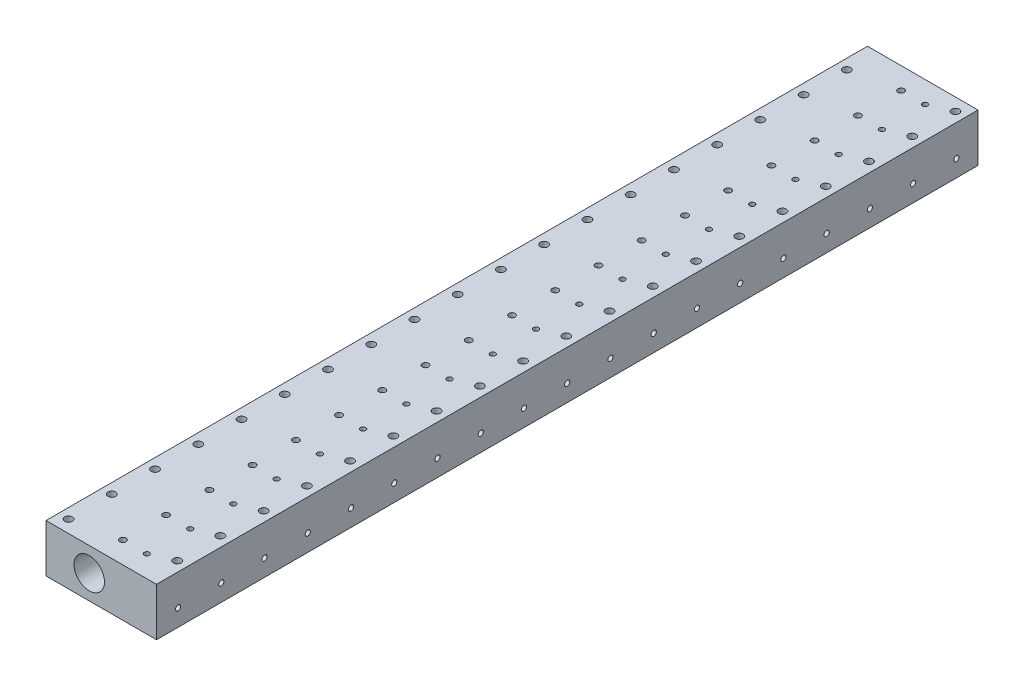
from build123d import *

# Parameters (mm, degrees)
SKETCH1_W                      = 23
SKETCH1_H                      = 10
BOSS_EXTRUDE1_DEPTH            = 171
SKETCH5_R                      = 3.175
CUT_EXTRUDE1_DEPTH             = 172.459178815
M2X0_4_TAPPED_HOLE1_AT_2_COUNT = 2
M2X0_4_TAPPED_HOLE1_AT_2_PITCH = 19.180198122
LPATTERN1_COUNT                = 19
LPATTERN1_PITCH                = 9


with BuildPart() as part:
    # Sketch1 → Boss-Extrude1 (new body)
    with BuildSketch(Plane.XY):
        Rectangle(SKETCH1_W, SKETCH1_H)
    extrude(amount=-BOSS_EXTRUDE1_DEPTH)

    # Sketch4 → 55 _0.052_ Diameter Hole1 (revolve, cut)
    with BuildSketch(Plane(origin=(0, 5, -4.5), x_dir=(0, 0, 1), z_dir=(1, 0, 0))):
        Polygon((0, 0), (0, 7.396808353), (0.6604, 7), (0.6604, 0), align=None)
    f_55_0_052_diameter_hole1 = revolve(axis=Axis((0, 11.35, -4.5), (0, -1, 0)), mode=Mode.SUBTRACT)

    # Sketch5 → Cut-Extrude1 (cut, through all)
    with BuildSketch(Plane.XY):
        with Locations((-2.5, 0)):
            Circle(SKETCH5_R)
    extrude(amount=-CUT_EXTRUDE1_DEPTH, mode=Mode.SUBTRACT)

    # Sketch8 → M2x0.4 Tapped Hole1 (revolve, cut)
    with BuildSketch(Plane(origin=(9.4, 5, -6.4), x_dir=(0, 0, 1), z_dir=(1, 0, 0))):
        Polygon((0, 0), (0, 5.680688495), (0.8, 5.2), (0.8, 0), align=None)
    m2x0_4_tapped_hole1 = revolve(axis=Axis((9.4, 11.35, -6.4), (0, -1, 0)), mode=Mode.SUBTRACT)

    # M2x0.4 Tapped Hole1 at 2: M2x0.4 Tapped Hole1 ×2
    with Locations(*[Vector(-0.9801775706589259, 0, 0.1981209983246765) * (i * M2X0_4_TAPPED_HOLE1_AT_2_PITCH) for i in range(1, M2X0_4_TAPPED_HOLE1_AT_2_COUNT)]):
        add(m2x0_4_tapped_hole1, mode=Mode.SUBTRACT)

    # Sketch12 → 57 _0.043_ Diameter Hole2 (revolve, cut)
    with BuildSketch(Plane(origin=(11.5, -1.5, -4.5), x_dir=(0, 0, -1), z_dir=(0, 1, 0))):
        Polygon((0, 0), (0, 6.328129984), (0.5461, 6), (0.5461, 0), align=None)
    f_57_0_043_diameter_hole2 = revolve(axis=Axis((17.85, -1.5, -4.5), (-1, 0, 0)), mode=Mode.SUBTRACT)

    # Sketch14 → 57 _0.043_ Diameter Hole1 (revolve, cut)
    with BuildSketch(Plane(origin=(5, 5, -4.5), x_dir=(0, 0, 1), z_dir=(1, 0, 0))):
        Polygon((0, 0), (0, 7.828129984), (0.5461, 7.5), (0.5461, 0), align=None)
    f_57_0_043_diameter_hole1 = revolve(axis=Axis((5, 11.35, -4.5), (0, -1, 0)), mode=Mode.SUBTRACT)

    # LPattern1: 55 _0.052_ Diameter Hole1, M2x0.4 Tapped Hole1, 57 _0.043_ Diameter Hole2, 57 _0.043_ Diameter Hole1 ×19
    with Locations(*[(0, 0, -i * LPATTERN1_PITCH) for i in range(1, LPATTERN1_COUNT)]):
        add(f_55_0_052_diameter_hole1, mode=Mode.SUBTRACT)
        add(m2x0_4_tapped_hole1, mode=Mode.SUBTRACT)
        add(f_57_0_043_diameter_hole2, mode=Mode.SUBTRACT)
        add(f_57_0_043_diameter_hole1, mode=Mode.SUBTRACT)

    # LPattern1 copy 1 sketch → LPattern1 copy 1 (revolve, cut)
    with BuildSketch(Plane(origin=(-9.4, 5, -11.6), x_dir=(0, 0, 1), z_dir=(1, 0, 0))):
        Polygon((0, 0), (0, 5.680688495), (0.8, 5.2), (0.8, 0), align=None)
    revolve(axis=Axis((-9.4, 11.35, -11.6), (0, -1, 0)), mode=Mode.SUBTRACT)

    # LPattern1 copy 2 sketch → LPattern1 copy 2 (revolve, cut)
    with BuildSketch(Plane(origin=(-9.4, 5, -20.6), x_dir=(0, 0, 1), z_dir=(1, 0, 0))):
        Polygon((0, 0), (0, 5.680688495), (0.8, 5.2), (0.8, 0), align=None)
    revolve(axis=Axis((-9.4, 11.35, -20.6), (0, -1, 0)), mode=Mode.SUBTRACT)

    # LPattern1 copy 3 sketch → LPattern1 copy 3 (revolve, cut)
    with BuildSketch(Plane(origin=(-9.4, 5, -29.6), x_dir=(0, 0, 1), z_dir=(1, 0, 0))):
        Polygon((0, 0), (0, 5.680688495), (0.8, 5.2), (0.8, 0), align=None)
    revolve(axis=Axis((-9.4, 11.35, -29.6), (0, -1, 0)), mode=Mode.SUBTRACT)

    # LPattern1 copy 4 sketch → LPattern1 copy 4 (revolve, cut)
    with BuildSketch(Plane(origin=(-9.4, 5, -38.6), x_dir=(0, 0, 1), z_dir=(1, 0, 0))):
        Polygon((0, 0), (0, 5.680688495), (0.8, 5.2), (0.8, 0), align=None)
    revolve(axis=Axis((-9.4, 11.35, -38.6), (0, -1, 0)), mode=Mode.SUBTRACT)

    # LPattern1 copy 5 sketch → LPattern1 copy 5 (revolve, cut)
    with BuildSketch(Plane(origin=(-9.4, 5, -47.6), x_dir=(0, 0, 1), z_dir=(1, 0, 0))):
        Polygon((0, 0), (0, 5.680688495), (0.8, 5.2), (0.8, 0), align=None)
    revolve(axis=Axis((-9.4, 11.35, -47.6), (0, -1, 0)), mode=Mode.SUBTRACT)

    # LPattern1 copy 6 sketch → LPattern1 copy 6 (revolve, cut)
    with BuildSketch(Plane(origin=(-9.4, 5, -56.6), x_dir=(0, 0, 1), z_dir=(1, 0, 0))):
        Polygon((0, 0), (0, 5.680688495), (0.8, 5.2), (0.8, 0), align=None)
    revolve(axis=Axis((-9.4, 11.35, -56.6), (0, -1, 0)), mode=Mode.SUBTRACT)

    # LPattern1 copy 7 sketch → LPattern1 copy 7 (revolve, cut)
    with BuildSketch(Plane(origin=(-9.4, 5, -65.6), x_dir=(0, 0, 1), z_dir=(1, 0, 0))):
        Polygon((0, 0), (0, 5.680688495), (0.8, 5.2), (0.8, 0), align=None)
    revolve(axis=Axis((-9.4, 11.35, -65.6), (0, -1, 0)), mode=Mode.SUBTRACT)

    # LPattern1 copy 8 sketch → LPattern1 copy 8 (revolve, cut)
    with BuildSketch(Plane(origin=(-9.4, 5, -74.6), x_dir=(0, 0, 1), z_dir=(1, 0, 0))):
        Polygon((0, 0), (0, 5.680688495), (0.8, 5.2), (0.8, 0), align=None)
    revolve(axis=Axis((-9.4, 11.35, -74.6), (0, -1, 0)), mode=Mode.SUBTRACT)

    # LPattern1 copy 9 sketch → LPattern1 copy 9 (revolve, cut)
    with BuildSketch(Plane(origin=(-9.4, 5, -83.6), x_dir=(0, 0, 1), z_dir=(1, 0, 0))):
        Polygon((0, 0), (0, 5.680688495), (0.8, 5.2), (0.8, 0), align=None)
    revolve(axis=Axis((-9.4, 11.35, -83.6), (0, -1, 0)), mode=Mode.SUBTRACT)

    # LPattern1 copy 10 sketch → LPattern1 copy 10 (revolve, cut)
    with BuildSketch(Plane(origin=(-9.4, 5, -92.6), x_dir=(0, 0, 1), z_dir=(1, 0, 0))):
        Polygon((0, 0), (0, 5.680688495), (0.8, 5.2), (0.8, 0), align=None)
    revolve(axis=Axis((-9.4, 11.35, -92.6), (0, -1, 0)), mode=Mode.SUBTRACT)

    # LPattern1 copy 11 sketch → LPattern1 copy 11 (revolve, cut)
    with BuildSketch(Plane(origin=(-9.4, 5, -101.6), x_dir=(0, 0, 1), z_dir=(1, 0, 0))):
        Polygon((0, 0), (0, 5.680688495), (0.8, 5.2), (0.8, 0), align=None)
    revolve(axis=Axis((-9.4, 11.35, -101.6), (0, -1, 0)), mode=Mode.SUBTRACT)

    # LPattern1 copy 12 sketch → LPattern1 copy 12 (revolve, cut)
    with BuildSketch(Plane(origin=(-9.4, 5, -110.6), x_dir=(0, 0, 1), z_dir=(1, 0, 0))):
        Polygon((0, 0), (0, 5.680688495), (0.8, 5.2), (0.8, 0), align=None)
    revolve(axis=Axis((-9.4, 11.35, -110.6), (0, -1, 0)), mode=Mode.SUBTRACT)

    # LPattern1 copy 13 sketch → LPattern1 copy 13 (revolve, cut)
    with BuildSketch(Plane(origin=(-9.4, 5, -119.6), x_dir=(0, 0, 1), z_dir=(1, 0, 0))):
        Polygon((0, 0), (0, 5.680688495), (0.8, 5.2), (0.8, 0), align=None)
    revolve(axis=Axis((-9.4, 11.35, -119.6), (0, -1, 0)), mode=Mode.SUBTRACT)

    # LPattern1 copy 14 sketch → LPattern1 copy 14 (revolve, cut)
    with BuildSketch(Plane(origin=(-9.4, 5, -128.6), x_dir=(0, 0, 1), z_dir=(1, 0, 0))):
        Polygon((0, 0), (0, 5.680688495), (0.8, 5.2), (0.8, 0), align=None)
    revolve(axis=Axis((-9.4, 11.35, -128.6), (0, -1, 0)), mode=Mode.SUBTRACT)

    # LPattern1 copy 15 sketch → LPattern1 copy 15 (revolve, cut)
    with BuildSketch(Plane(origin=(-9.4, 5, -137.6), x_dir=(0, 0, 1), z_dir=(1, 0, 0))):
        Polygon((0, 0), (0, 5.680688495), (0.8, 5.2), (0.8, 0), align=None)
    revolve(axis=Axis((-9.4, 11.35, -137.6), (0, -1, 0)), mode=Mode.SUBTRACT)

    # LPattern1 copy 16 sketch → LPattern1 copy 16 (revolve, cut)
    with BuildSketch(Plane(origin=(-9.4, 5, -146.6), x_dir=(0, 0, 1), z_dir=(1, 0, 0))):
        Polygon((0, 0), (0, 5.680688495), (0.8, 5.2), (0.8, 0), align=None)
    revolve(axis=Axis((-9.4, 11.35, -146.6), (0, -1, 0)), mode=Mode.SUBTRACT)

    # LPattern1 copy 17 sketch → LPattern1 copy 17 (revolve, cut)
    with BuildSketch(Plane(origin=(-9.4, 5, -155.6), x_dir=(0, 0, 1), z_dir=(1, 0, 0))):
        Polygon((0, 0), (0, 5.680688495), (0.8, 5.2), (0.8, 0), align=None)
    revolve(axis=Axis((-9.4, 11.35, -155.6), (0, -1, 0)), mode=Mode.SUBTRACT)

    # LPattern1 copy 18 sketch → LPattern1 copy 18 (revolve, cut)
    with BuildSketch(Plane(origin=(-9.4, 5, -164.6), x_dir=(0, 0, 1), z_dir=(1, 0, 0))):
        Polygon((0, 0), (0, 5.680688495), (0.8, 5.2), (0.8, 0), align=None)
    revolve(axis=Axis((-9.4, 11.35, -164.6), (0, -1, 0)), mode=Mode.SUBTRACT)


solid = part.part
